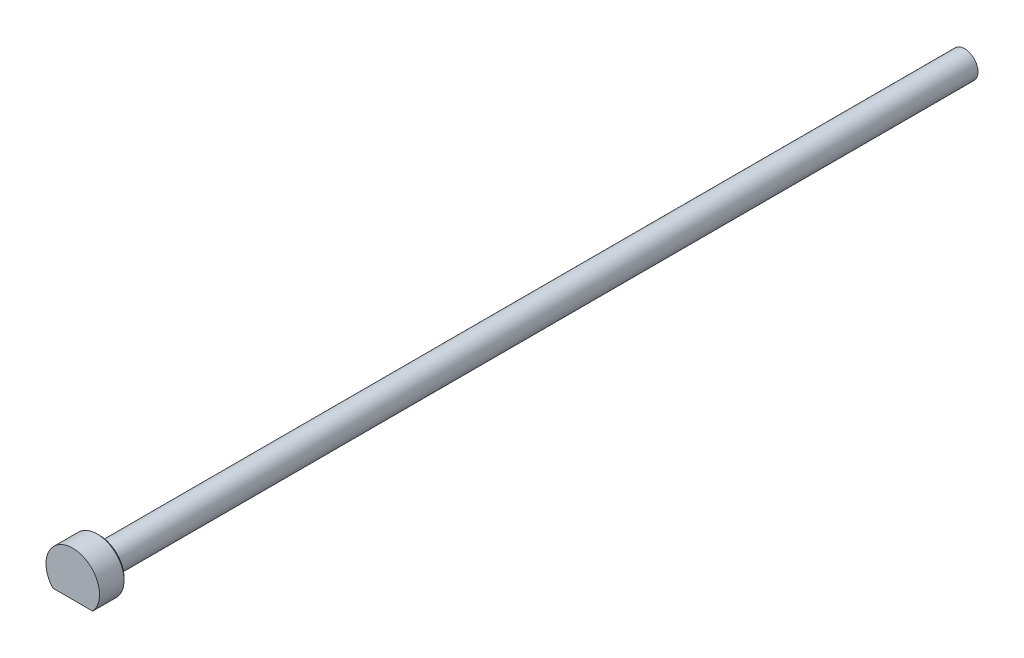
ISO-10303-21;
HEADER;
FILE_DESCRIPTION(('STEP AP214'),'2;1');
FILE_NAME('part.step','',(''),(''),'','','');
FILE_SCHEMA(('AUTOMOTIVE_DESIGN { 1 0 10303 214 1 1 1 1 }'));
ENDSEC;
DATA;
#1=APPLICATION_CONTEXT('core data for automotive mechanical design processes');
#2=APPLICATION_PROTOCOL_DEFINITION('international standard','automotive_design',2000,#1);
#3=PRODUCT_CONTEXT('',#1,'mechanical');
#4=PRODUCT('Part','Part','',(#3));
#5=PRODUCT_RELATED_PRODUCT_CATEGORY('part','',(#4));
#6=PRODUCT_DEFINITION_FORMATION('','',#4);
#7=PRODUCT_DEFINITION_CONTEXT('part definition',#1,'design');
#8=PRODUCT_DEFINITION('design','',#6,#7);
#9=PRODUCT_DEFINITION_SHAPE('','',#8);
#10=(LENGTH_UNIT() NAMED_UNIT(*) SI_UNIT(.MILLI.,.METRE.));
#11=(NAMED_UNIT(*) PLANE_ANGLE_UNIT() SI_UNIT($,.RADIAN.));
#12=(NAMED_UNIT(*) SI_UNIT($,.STERADIAN.) SOLID_ANGLE_UNIT());
#13=UNCERTAINTY_MEASURE_WITH_UNIT(LENGTH_MEASURE(1.E-05),#10,'distance_accuracy_value','');
#14=(GEOMETRIC_REPRESENTATION_CONTEXT(3) GLOBAL_UNCERTAINTY_ASSIGNED_CONTEXT((#13)) GLOBAL_UNIT_ASSIGNED_CONTEXT((#10,
#11,#12)) REPRESENTATION_CONTEXT('',''));
#15=CARTESIAN_POINT('',(0.,0.,0.));
#16=DIRECTION('',(0.,0.,1.));
#17=DIRECTION('',(1.,0.,0.));
#18=AXIS2_PLACEMENT_3D('',#15,#16,#17);
#19=CARTESIAN_POINT('',(0.,1.50000000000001,-100.));
#20=DIRECTION('',(0.,0.,-1.));
#21=DIRECTION('',(-1.,0.,0.));
#22=AXIS2_PLACEMENT_3D('',#19,#20,#21);
#23=PLANE('',#22);
#24=CARTESIAN_POINT('',(0.,0.,-100.));
#25=DIRECTION('',(0.,0.,-1.));
#26=DIRECTION('',(-1.,0.,0.));
#27=AXIS2_PLACEMENT_3D('',#24,#25,#26);
#28=CIRCLE('',#27,1.50000000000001);
#29=CARTESIAN_POINT('',(-1.50000000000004,0.,-100.));
#30=VERTEX_POINT('',#29);
#31=EDGE_CURVE('E39',#30,#30,#28,.T.);
#32=ORIENTED_EDGE('',*,*,#31,.T.);
#33=EDGE_LOOP('',(#32));
#34=FACE_BOUND('',#33,.T.);
#35=ADVANCED_FACE('F32',(#34),#23,.T.);
#36=CARTESIAN_POINT('',(0.,0.,0.));
#37=DIRECTION('',(0.,0.,-1.));
#38=DIRECTION('',(-1.,0.,0.));
#39=AXIS2_PLACEMENT_3D('',#36,#37,#38);
#40=CYLINDRICAL_SURFACE('',#39,1.5);
#41=CARTESIAN_POINT('',(0.,0.,-3.3));
#42=DIRECTION('',(0.,0.,-1.));
#43=DIRECTION('',(-1.,0.,0.));
#44=AXIS2_PLACEMENT_3D('',#41,#42,#43);
#45=CIRCLE('',#44,1.49999999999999);
#46=CARTESIAN_POINT('',(-1.50000000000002,0.,-3.3));
#47=VERTEX_POINT('',#46);
#48=EDGE_CURVE('E115',#47,#47,#45,.T.);
#49=ORIENTED_EDGE('',*,*,#48,.T.);
#50=EDGE_LOOP('',(#49));
#51=FACE_BOUND('',#50,.T.);
#52=ORIENTED_EDGE('',*,*,#31,.F.);
#53=EDGE_LOOP('',(#52));
#54=FACE_BOUND('',#53,.T.);
#55=ADVANCED_FACE('F105',(#51,#54),#40,.T.);
#56=CARTESIAN_POINT('',(0.,0.,-3.3));
#57=DIRECTION('',(0.,0.,-1.));
#58=DIRECTION('',(-1.,0.,0.));
#59=AXIS2_PLACEMENT_3D('',#56,#57,#58);
#60=TOROIDAL_SURFACE('',#59,1.79999999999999,0.300000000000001);
#61=CARTESIAN_POINT('',(0.,0.,-3.));
#62=DIRECTION('',(0.,0.,-1.));
#63=DIRECTION('',(-1.,0.,0.));
#64=AXIS2_PLACEMENT_3D('',#61,#62,#63);
#65=CIRCLE('',#64,1.79999999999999);
#66=CARTESIAN_POINT('',(-1.80000000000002,0.,-3.));
#67=VERTEX_POINT('',#66);
#68=EDGE_CURVE('E117',#67,#67,#65,.T.);
#69=ORIENTED_EDGE('',*,*,#68,.T.);
#70=EDGE_LOOP('',(#69));
#71=FACE_BOUND('',#70,.T.);
#72=ORIENTED_EDGE('',*,*,#48,.F.);
#73=EDGE_LOOP('',(#72));
#74=FACE_BOUND('',#73,.T.);
#75=ADVANCED_FACE('F110',(#71,#74),#60,.F.);
#76=CARTESIAN_POINT('',(0.,2.75,-3.));
#77=DIRECTION('',(0.,0.,-1.));
#78=DIRECTION('',(-1.,0.,0.));
#79=AXIS2_PLACEMENT_3D('',#76,#77,#78);
#80=PLANE('',#79);
#81=DIRECTION('',(1.,0.,0.));
#82=VECTOR('',#81,1.);
#83=CARTESIAN_POINT('',(0.,-2.,-3.));
#84=LINE('',#83,#82);
#85=CARTESIAN_POINT('',(-1.88745860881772,-2.,-3.));
#86=VERTEX_POINT('',#85);
#87=CARTESIAN_POINT('',(1.88745860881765,-2.,-3.));
#88=VERTEX_POINT('',#87);
#89=EDGE_CURVE('E45',#86,#88,#84,.T.);
#90=ORIENTED_EDGE('',*,*,#89,.F.);
#91=CARTESIAN_POINT('',(0.,0.,-3.));
#92=DIRECTION('',(0.,0.,-1.));
#93=DIRECTION('',(-1.,0.,0.));
#94=AXIS2_PLACEMENT_3D('',#91,#92,#93);
#95=CIRCLE('',#94,2.75);
#96=EDGE_CURVE('E122',#86,#88,#95,.T.);
#97=ORIENTED_EDGE('',*,*,#96,.T.);
#98=EDGE_LOOP('',(#90,#97));
#99=FACE_BOUND('',#98,.T.);
#100=ORIENTED_EDGE('',*,*,#68,.F.);
#101=EDGE_LOOP('',(#100));
#102=FACE_BOUND('',#101,.T.);
#103=ADVANCED_FACE('F103',(#99,#102),#80,.T.);
#104=CARTESIAN_POINT('',(0.,0.,-3.));
#105=DIRECTION('',(0.,0.,1.));
#106=DIRECTION('',(1.,0.,0.));
#107=AXIS2_PLACEMENT_3D('',#104,#105,#106);
#108=CONICAL_SURFACE('',#107,2.75,0.785398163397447);
#109=CARTESIAN_POINT('',(-6.29316161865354,-2.,0.853323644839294));
#110=CARTESIAN_POINT('',(-6.18215280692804,-2.,0.747530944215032));
#111=CARTESIAN_POINT('',(-6.07101802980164,-2.,0.641870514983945));
#112=CARTESIAN_POINT('',(-5.84844826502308,-2.,0.430864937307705));
#113=CARTESIAN_POINT('',(-5.73701327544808,-2.,0.32551979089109));
#114=CARTESIAN_POINT('',(-5.40211454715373,-2.,0.00996648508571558));
#115=CARTESIAN_POINT('',(-5.1781297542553,-2.,-0.199690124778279));
#116=CARTESIAN_POINT('',(-4.72592354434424,-2.,-0.619005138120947));
#117=CARTESIAN_POINT('',(-4.49768219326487,-2.,-0.828642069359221));
#118=CARTESIAN_POINT('',(-4.03830377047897,-2.,-1.24463758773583));
#119=CARTESIAN_POINT('',(-3.8071673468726,-2.,-1.45099688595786));
#120=CARTESIAN_POINT('',(-3.41325098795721,-2.,-1.79472470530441));
#121=CARTESIAN_POINT('',(-3.25169335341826,-2.,-1.93349127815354));
#122=CARTESIAN_POINT('',(-2.92538513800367,-2.,-2.20741240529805));
#123=CARTESIAN_POINT('',(-2.7606330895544,-2.,-2.34256522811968));
#124=CARTESIAN_POINT('',(-2.51025537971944,-2.,-2.54082111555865));
#125=CARTESIAN_POINT('',(-2.42634832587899,-2.,-2.60609171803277));
#126=CARTESIAN_POINT('',(-2.25712474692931,-2.,-2.73477522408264));
#127=CARTESIAN_POINT('',(-2.1718083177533,-2.,-2.79818825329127));
#128=CARTESIAN_POINT('',(-1.99949292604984,-2.,-2.92255971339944));
#129=CARTESIAN_POINT('',(-1.9124952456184,-2.,-2.98351991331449));
#130=CARTESIAN_POINT('',(-1.73634842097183,-2.,-3.10223405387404));
#131=CARTESIAN_POINT('',(-1.6471997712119,-2.,-3.15998872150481));
#132=CARTESIAN_POINT('',(-1.48767935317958,-2.,-3.25796681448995));
#133=CARTESIAN_POINT('',(-1.4178684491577,-2.,-3.29909961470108));
#134=CARTESIAN_POINT('',(-1.27640772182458,-2.,-3.37812897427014));
#135=CARTESIAN_POINT('',(-1.20475760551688,-2.,-3.41602501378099));
#136=CARTESIAN_POINT('',(-1.05946597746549,-2.,-3.48759505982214));
#137=CARTESIAN_POINT('',(-0.98582695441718,-2.,-3.5212740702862));
#138=CARTESIAN_POINT('',(-0.836308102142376,-2.,-3.58325369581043));
#139=CARTESIAN_POINT('',(-0.760429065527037,-2.,-3.61155618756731));
#140=CARTESIAN_POINT('',(-0.625393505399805,-2.,-3.65522027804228));
#141=CARTESIAN_POINT('',(-0.566714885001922,-2.,-3.67205259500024));
#142=CARTESIAN_POINT('',(-0.448250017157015,-2.,-3.70118672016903));
#143=CARTESIAN_POINT('',(-0.388464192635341,-2.,-3.71349022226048));
#144=CARTESIAN_POINT('',(-0.268234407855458,-2.,-3.73296158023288));
#145=CARTESIAN_POINT('',(-0.207792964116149,-2.,-3.7401447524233));
#146=CARTESIAN_POINT('',(-0.0865047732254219,-2.,-3.74904346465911));
#147=CARTESIAN_POINT('',(-0.0256580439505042,-2.,-3.75075924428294));
#148=CARTESIAN_POINT('',(0.0960594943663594,-2.,-3.74862126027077));
#149=CARTESIAN_POINT('',(0.156930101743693,-2.,-3.7447561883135));
#150=CARTESIAN_POINT('',(0.278085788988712,-2.,-3.73165849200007));
#151=CARTESIAN_POINT('',(0.338370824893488,-2.,-3.72242546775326));
#152=CARTESIAN_POINT('',(0.458161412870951,-2.,-3.69903759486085));
#153=CARTESIAN_POINT('',(0.517663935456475,-2.,-3.68486743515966));
#154=CARTESIAN_POINT('',(0.635464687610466,-2.,-3.65223626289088));
#155=CARTESIAN_POINT('',(0.693762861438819,-2.,-3.63377505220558));
#156=CARTESIAN_POINT('',(0.882825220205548,-2.,-3.56729171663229));
#157=CARTESIAN_POINT('',(1.01091361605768,-2.,-3.51165923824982));
#158=CARTESIAN_POINT('',(1.26106337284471,-2.,-3.38813649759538));
#159=CARTESIAN_POINT('',(1.38311167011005,-2.,-3.32022102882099));
#160=CARTESIAN_POINT('',(1.62408270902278,-2.,-3.17545914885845));
#161=CARTESIAN_POINT('',(1.74293713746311,-2.,-3.09850033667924));
#162=CARTESIAN_POINT('',(1.91834406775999,-2.,-2.97903718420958));
#163=CARTESIAN_POINT('',(1.97630829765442,-2.,-2.93856457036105));
#164=CARTESIAN_POINT('',(2.09142723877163,-2.,-2.85648386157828));
#165=CARTESIAN_POINT('',(2.14858196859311,-2.,-2.8148757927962));
#166=CARTESIAN_POINT('',(2.30105077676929,-2.,-2.70193592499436));
#167=CARTESIAN_POINT('',(2.39572427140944,-2.,-2.62974062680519));
#168=CARTESIAN_POINT('',(2.58350719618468,-2.,-2.48333945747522));
#169=CARTESIAN_POINT('',(2.67661650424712,-2.,-2.40913343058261));
#170=CARTESIAN_POINT('',(2.95412889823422,-2.,-2.18418407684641));
#171=CARTESIAN_POINT('',(3.13666887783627,-2.,-2.03114550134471));
#172=CARTESIAN_POINT('',(3.49875769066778,-2.,-1.72102344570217));
#173=CARTESIAN_POINT('',(3.6783012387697,-2.,-1.56393385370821));
#174=CARTESIAN_POINT('',(4.03507695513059,-2.,-1.24721103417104));
#175=CARTESIAN_POINT('',(4.21230947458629,-2.,-1.08757820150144));
#176=CARTESIAN_POINT('',(4.54965489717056,-2.,-0.780600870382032));
#177=CARTESIAN_POINT('',(4.70990542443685,-2.,-0.633407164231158));
#178=CARTESIAN_POINT('',(5.02937466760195,-2.,-0.337890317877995));
#179=CARTESIAN_POINT('',(5.18859333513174,-2.,-0.189567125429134));
#180=CARTESIAN_POINT('',(5.50573460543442,-2.,0.107476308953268));
#181=CARTESIAN_POINT('',(5.66365969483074,-2.,0.256193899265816));
#182=CARTESIAN_POINT('',(5.97885772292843,-2.,0.554298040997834));
#183=CARTESIAN_POINT('',(6.13613070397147,-2.,0.703684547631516));
#184=CARTESIAN_POINT('',(6.29316161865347,-2.,0.853323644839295));
#185=B_SPLINE_CURVE_WITH_KNOTS('',3,(#109,#110,#111,#112,#113,#114,#115,#116,#117,#118,#119,
#120,#121,#122,#123,#124,#125,#126,#127,#128,#129,#130,#131,#132,#133,#134,#135,#136,#137,#138,
#139,#140,#141,#142,#143,#144,#145,#146,#147,#148,#149,#150,#151,#152,#153,#154,#155,#156,#157,
#158,#159,#160,#161,#162,#163,#164,#165,#166,#167,#168,#169,#170,#171,#172,#173,#174,#175,#176,
#177,#178,#179,#180,#181,#182,#183,#184),.UNSPECIFIED.,.F.,.F.,(4,2,2,2,2,2,2,2,2,2,2,2,2,2,2,2,
2,2,2,2,2,2,2,2,2,2,2,2,2,2,2,2,2,2,2,2,2,4),(0.,0.460038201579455,0.920079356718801,
1.84046322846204,2.77016540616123,3.69966305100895,4.33854878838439,4.97773534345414,
5.29662996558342,5.61550296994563,5.93414171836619,6.25270790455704,6.49572516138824,
6.73878137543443,6.98154638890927,7.22422650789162,7.40721031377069,7.59012560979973,
7.77249143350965,7.95484926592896,8.13757712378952,8.32031859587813,8.5036319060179,
8.68695368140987,9.10472792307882,9.52336943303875,9.94791241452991,10.1599916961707,
10.3720660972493,10.7292067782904,11.0863752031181,11.8008909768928,12.5165563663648,
13.2321117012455,13.8848811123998,14.5376809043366,15.1884593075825,15.8391947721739),.UNSPECIFIED.);
#186=CARTESIAN_POINT('',(-2.23606797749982,-2.,-2.75));
#187=VERTEX_POINT('',#186);
#188=EDGE_CURVE('E83',#187,#86,#185,.T.);
#189=ORIENTED_EDGE('',*,*,#188,.F.);
#190=CARTESIAN_POINT('',(0.,0.,-2.75));
#191=DIRECTION('',(0.,0.,-1.));
#192=DIRECTION('',(-1.,0.,0.));
#193=AXIS2_PLACEMENT_3D('',#190,#191,#192);
#194=CIRCLE('',#193,3.);
#195=CARTESIAN_POINT('',(2.23606797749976,-2.,-2.75));
#196=VERTEX_POINT('',#195);
#197=EDGE_CURVE('E71',#187,#196,#194,.T.);
#198=ORIENTED_EDGE('',*,*,#197,.T.);
#199=EDGE_CURVE('E52',#88,#196,#185,.T.);
#200=ORIENTED_EDGE('',*,*,#199,.F.);
#201=ORIENTED_EDGE('',*,*,#96,.F.);
#202=EDGE_LOOP('',(#189,#198,#200,#201));
#203=FACE_BOUND('',#202,.T.);
#204=ADVANCED_FACE('F91',(#203),#108,.T.);
#205=CARTESIAN_POINT('',(0.,0.,0.));
#206=DIRECTION('',(0.,0.,-1.));
#207=DIRECTION('',(-1.,0.,0.));
#208=AXIS2_PLACEMENT_3D('',#205,#206,#207);
#209=CYLINDRICAL_SURFACE('',#208,3.);
#210=DIRECTION('',(0.,0.,-1.));
#211=VECTOR('',#210,1.);
#212=CARTESIAN_POINT('',(2.23606797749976,-2.,0.));
#213=LINE('',#212,#211);
#214=CARTESIAN_POINT('',(2.23606797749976,-2.,0.));
#215=VERTEX_POINT('',#214);
#216=EDGE_CURVE('E79',#196,#215,#213,.F.);
#217=ORIENTED_EDGE('',*,*,#216,.F.);
#218=ORIENTED_EDGE('',*,*,#197,.F.);
#219=DIRECTION('',(0.,0.,-1.));
#220=VECTOR('',#219,1.);
#221=CARTESIAN_POINT('',(-2.23606797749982,-2.,0.));
#222=LINE('',#221,#220);
#223=CARTESIAN_POINT('',(-2.23606797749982,-2.,0.));
#224=VERTEX_POINT('',#223);
#225=EDGE_CURVE('E75',#224,#187,#222,.T.);
#226=ORIENTED_EDGE('',*,*,#225,.F.);
#227=CARTESIAN_POINT('',(0.,0.,0.));
#228=DIRECTION('',(0.,0.,-1.));
#229=DIRECTION('',(-1.,0.,0.));
#230=AXIS2_PLACEMENT_3D('',#227,#228,#229);
#231=CIRCLE('',#230,3.);
#232=EDGE_CURVE('E66',#224,#215,#231,.T.);
#233=ORIENTED_EDGE('',*,*,#232,.T.);
#234=EDGE_LOOP('',(#217,#218,#226,#233));
#235=FACE_BOUND('',#234,.T.);
#236=ADVANCED_FACE('F76',(#235),#209,.T.);
#237=CARTESIAN_POINT('',(0.,0.,0.));
#238=DIRECTION('',(0.,0.,1.));
#239=DIRECTION('',(1.,0.,0.));
#240=AXIS2_PLACEMENT_3D('',#237,#238,#239);
#241=PLANE('',#240);
#242=DIRECTION('',(-1.,0.,0.));
#243=VECTOR('',#242,1.);
#244=CARTESIAN_POINT('',(0.,-2.,0.));
#245=LINE('',#244,#243);
#246=EDGE_CURVE('E11',#215,#224,#245,.T.);
#247=ORIENTED_EDGE('',*,*,#246,.F.);
#248=ORIENTED_EDGE('',*,*,#232,.F.);
#249=EDGE_LOOP('',(#247,#248));
#250=FACE_BOUND('',#249,.T.);
#251=ADVANCED_FACE('F68',(#250),#241,.T.);
#252=CARTESIAN_POINT('',(-50.,-2.,250.449192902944));
#253=DIRECTION('',(0.,1.,0.));
#254=DIRECTION('',(0.,0.,1.));
#255=AXIS2_PLACEMENT_3D('',#252,#253,#254);
#256=PLANE('',#255);
#257=ORIENTED_EDGE('',*,*,#188,.T.);
#258=ORIENTED_EDGE('',*,*,#89,.T.);
#259=ORIENTED_EDGE('',*,*,#199,.T.);
#260=ORIENTED_EDGE('',*,*,#216,.T.);
#261=ORIENTED_EDGE('',*,*,#246,.T.);
#262=ORIENTED_EDGE('',*,*,#225,.T.);
#263=EDGE_LOOP('',(#257,#258,#259,#260,#261,#262));
#264=FACE_BOUND('',#263,.T.);
#265=ADVANCED_FACE('F81',(#264),#256,.F.);
#266=CLOSED_SHELL('',(#35,#55,#75,#103,#204,#236,#251,#265));
#267=MANIFOLD_SOLID_BREP('B2',#266);
#268=ADVANCED_BREP_SHAPE_REPRESENTATION('',(#18,#267),#14);
#269=SHAPE_DEFINITION_REPRESENTATION(#9,#268);
ENDSEC;
END-ISO-10303-21;
